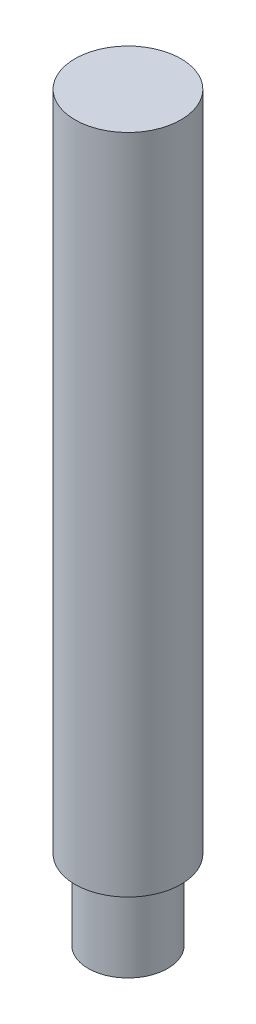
from build123d import *

# Parameters (mm, degrees)
SKETCH1_R      = 3
EXTRUDE1_DEPTH = 6
SKETCH2_R      = 4
EXTRUDE2_DEPTH = 50


with BuildPart() as part:
    # Sketch1 → Extrude1 (new body)
    with BuildSketch(Plane(origin=(0, 0, 0), x_dir=(1, 0, 0), z_dir=(0, 1, 0))):
        with Locations(Location((0, 0, 0), (0, 0, 270))):
            Circle(SKETCH1_R)
    extrude(amount=EXTRUDE1_DEPTH)

    # Sketch2 → Extrude2 (add)
    with BuildSketch(Plane(origin=(0, 6, 0), x_dir=(1, 0, 0), z_dir=(0, 1, 0))):
        with Locations(Location((0, 0, 0), (0, 0, 270))):
            Circle(SKETCH2_R)
    extrude(amount=EXTRUDE2_DEPTH)


solid = part.part
